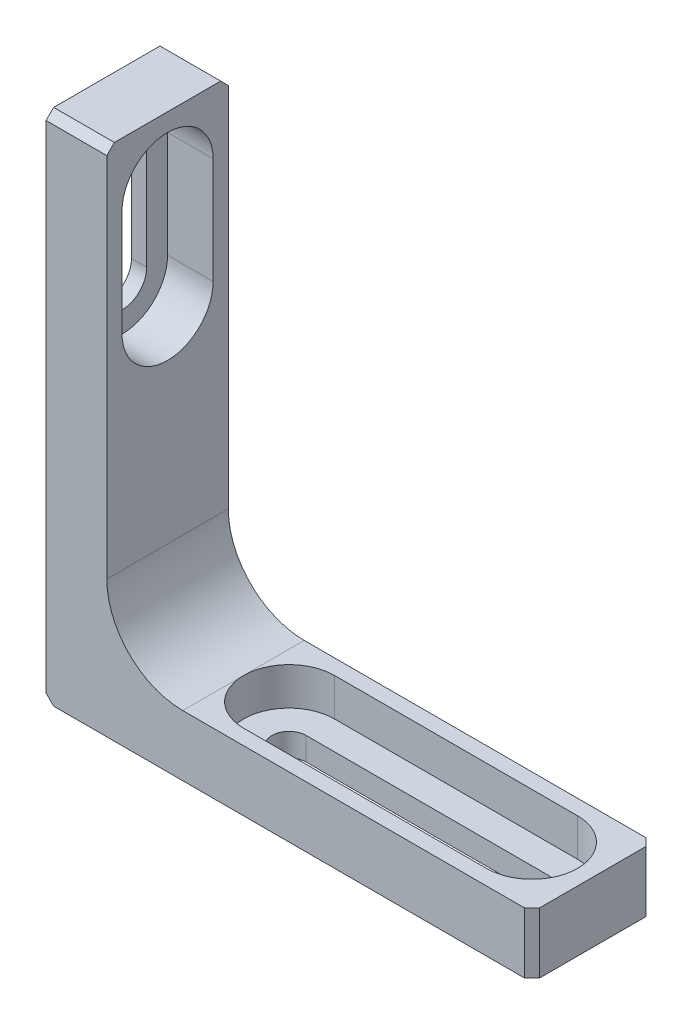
ISO-10303-21;
HEADER;
FILE_DESCRIPTION(('STEP AP214'),'2;1');
FILE_NAME('part.step','',(''),(''),'','','');
FILE_SCHEMA(('AUTOMOTIVE_DESIGN { 1 0 10303 214 1 1 1 1 }'));
ENDSEC;
DATA;
#1=APPLICATION_CONTEXT('core data for automotive mechanical design processes');
#2=APPLICATION_PROTOCOL_DEFINITION('international standard','automotive_design',2000,#1);
#3=PRODUCT_CONTEXT('',#1,'mechanical');
#4=PRODUCT('Part','Part','',(#3));
#5=PRODUCT_RELATED_PRODUCT_CATEGORY('part','',(#4));
#6=PRODUCT_DEFINITION_FORMATION('','',#4);
#7=PRODUCT_DEFINITION_CONTEXT('part definition',#1,'design');
#8=PRODUCT_DEFINITION('design','',#6,#7);
#9=PRODUCT_DEFINITION_SHAPE('','',#8);
#10=(LENGTH_UNIT() NAMED_UNIT(*) SI_UNIT(.MILLI.,.METRE.));
#11=(NAMED_UNIT(*) PLANE_ANGLE_UNIT() SI_UNIT($,.RADIAN.));
#12=(NAMED_UNIT(*) SI_UNIT($,.STERADIAN.) SOLID_ANGLE_UNIT());
#13=UNCERTAINTY_MEASURE_WITH_UNIT(LENGTH_MEASURE(1.E-05),#10,'distance_accuracy_value','');
#14=(GEOMETRIC_REPRESENTATION_CONTEXT(3) GLOBAL_UNCERTAINTY_ASSIGNED_CONTEXT((#13)) GLOBAL_UNIT_ASSIGNED_CONTEXT((#10,
#11,#12)) REPRESENTATION_CONTEXT('',''));
#15=CARTESIAN_POINT('',(0.,0.,0.));
#16=DIRECTION('',(0.,0.,1.));
#17=DIRECTION('',(1.,0.,0.));
#18=AXIS2_PLACEMENT_3D('',#15,#16,#17);
#19=CARTESIAN_POINT('',(12.7,106.828844,-12.7));
#20=DIRECTION('',(-1.,0.,0.));
#21=DIRECTION('',(0.,-1.,0.));
#22=AXIS2_PLACEMENT_3D('',#19,#20,#21);
#23=PLANE('',#22);
#24=DIRECTION('',(0.,-1.,0.));
#25=VECTOR('',#24,1.);
#26=CARTESIAN_POINT('',(12.7,106.828844,-12.7));
#27=LINE('',#26,#25);
#28=CARTESIAN_POINT('',(12.7,105.241344,-12.7));
#29=VERTEX_POINT('',#28);
#30=CARTESIAN_POINT('',(12.7,28.5750000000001,-12.7));
#31=VERTEX_POINT('',#30);
#32=EDGE_CURVE('E345',#29,#31,#27,.T.);
#33=ORIENTED_EDGE('',*,*,#32,.F.);
#34=DIRECTION('',(0.,0.707106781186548,0.707106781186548));
#35=VECTOR('',#34,1.);
#36=CARTESIAN_POINT('',(12.7,106.828844,-11.1125));
#37=LINE('',#36,#35);
#38=CARTESIAN_POINT('',(12.7,106.828844,-11.1125));
#39=VERTEX_POINT('',#38);
#40=EDGE_CURVE('E436',#29,#39,#37,.T.);
#41=ORIENTED_EDGE('',*,*,#40,.T.);
#42=DIRECTION('',(0.,0.,1.));
#43=VECTOR('',#42,1.);
#44=CARTESIAN_POINT('',(12.7,106.828844,-12.7));
#45=LINE('',#44,#43);
#46=CARTESIAN_POINT('',(12.7,106.828844,11.1125));
#47=VERTEX_POINT('',#46);
#48=EDGE_CURVE('E353',#39,#47,#45,.T.);
#49=ORIENTED_EDGE('',*,*,#48,.T.);
#50=DIRECTION('',(0.,0.707106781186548,-0.707106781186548));
#51=VECTOR('',#50,1.);
#52=CARTESIAN_POINT('',(12.7,105.241344,12.7));
#53=LINE('',#52,#51);
#54=CARTESIAN_POINT('',(12.7,105.241344,12.7));
#55=VERTEX_POINT('',#54);
#56=EDGE_CURVE('E434',#47,#55,#53,.F.);
#57=ORIENTED_EDGE('',*,*,#56,.T.);
#58=DIRECTION('',(0.,-1.,0.));
#59=VECTOR('',#58,1.);
#60=CARTESIAN_POINT('',(12.7,106.828844,12.7));
#61=LINE('',#60,#59);
#62=CARTESIAN_POINT('',(12.7,28.5750000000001,12.7));
#63=VERTEX_POINT('',#62);
#64=EDGE_CURVE('E329',#55,#63,#61,.T.);
#65=ORIENTED_EDGE('',*,*,#64,.T.);
#66=DIRECTION('',(0.,0.,1.));
#67=VECTOR('',#66,1.);
#68=CARTESIAN_POINT('',(12.7,28.5750000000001,-12.7));
#69=LINE('',#68,#67);
#70=EDGE_CURVE('E362',#31,#63,#69,.T.);
#71=ORIENTED_EDGE('',*,*,#70,.F.);
#72=EDGE_LOOP('',(#33,#41,#49,#57,#65,#71));
#73=FACE_BOUND('',#72,.T.);
#74=CARTESIAN_POINT('',(12.7,71.332344,0.));
#75=DIRECTION('',(-1.,0.,0.));
#76=DIRECTION('',(0.,-1.,0.));
#77=AXIS2_PLACEMENT_3D('',#74,#75,#76);
#78=CIRCLE('',#77,9.525);
#79=CARTESIAN_POINT('',(12.7,71.332344,9.525));
#80=VERTEX_POINT('',#79);
#81=CARTESIAN_POINT('',(12.7,71.332344,-9.525));
#82=VERTEX_POINT('',#81);
#83=EDGE_CURVE('E11',#80,#82,#78,.F.);
#84=ORIENTED_EDGE('',*,*,#83,.F.);
#85=DIRECTION('',(0.,-1.,0.));
#86=VECTOR('',#85,1.);
#87=CARTESIAN_POINT('',(12.7,106.828844,9.52500000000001));
#88=LINE('',#87,#86);
#89=CARTESIAN_POINT('',(12.7,93.557344,9.52500000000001));
#90=VERTEX_POINT('',#89);
#91=EDGE_CURVE('E440',#90,#80,#88,.T.);
#92=ORIENTED_EDGE('',*,*,#91,.F.);
#93=CARTESIAN_POINT('',(12.7,93.557344,0.));
#94=DIRECTION('',(-1.,0.,0.));
#95=DIRECTION('',(0.,-1.,0.));
#96=AXIS2_PLACEMENT_3D('',#93,#94,#95);
#97=CIRCLE('',#96,9.525);
#98=CARTESIAN_POINT('',(12.7,93.557344,-9.52499999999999));
#99=VERTEX_POINT('',#98);
#100=EDGE_CURVE('E442',#99,#90,#97,.F.);
#101=ORIENTED_EDGE('',*,*,#100,.F.);
#102=DIRECTION('',(0.,1.,0.));
#103=VECTOR('',#102,1.);
#104=CARTESIAN_POINT('',(12.7,106.828844,-9.525));
#105=LINE('',#104,#103);
#106=EDGE_CURVE('E45',#82,#99,#105,.T.);
#107=ORIENTED_EDGE('',*,*,#106,.F.);
#108=EDGE_LOOP('',(#84,#92,#101,#107));
#109=FACE_BOUND('',#108,.T.);
#110=ADVANCED_FACE('F37',(#73,#109),#23,.F.);
#111=CARTESIAN_POINT('',(0.,71.332344,0.));
#112=DIRECTION('',(1.,0.,0.));
#113=DIRECTION('',(0.,1.,0.));
#114=AXIS2_PLACEMENT_3D('',#111,#112,#113);
#115=CYLINDRICAL_SURFACE('',#114,5.1562);
#116=CARTESIAN_POINT('',(3.17499999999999,71.332344,0.));
#117=DIRECTION('',(1.,0.,0.));
#118=DIRECTION('',(0.,1.,0.));
#119=AXIS2_PLACEMENT_3D('',#116,#117,#118);
#120=CIRCLE('',#119,5.1562);
#121=CARTESIAN_POINT('',(3.17499999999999,71.332344,-5.1562));
#122=VERTEX_POINT('',#121);
#123=CARTESIAN_POINT('',(3.17499999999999,71.332344,5.1562));
#124=VERTEX_POINT('',#123);
#125=EDGE_CURVE('E258',#122,#124,#120,.F.);
#126=ORIENTED_EDGE('',*,*,#125,.F.);
#127=DIRECTION('',(1.,0.,0.));
#128=VECTOR('',#127,1.);
#129=CARTESIAN_POINT('',(0.,71.332344,-5.1562));
#130=LINE('',#129,#128);
#131=CARTESIAN_POINT('',(0.,71.332344,-5.1562));
#132=VERTEX_POINT('',#131);
#133=EDGE_CURVE('E325',#132,#122,#130,.T.);
#134=ORIENTED_EDGE('',*,*,#133,.F.);
#135=CARTESIAN_POINT('',(0.,71.332344,0.));
#136=DIRECTION('',(1.,0.,0.));
#137=DIRECTION('',(0.,1.,0.));
#138=AXIS2_PLACEMENT_3D('',#135,#136,#137);
#139=CIRCLE('',#138,5.1562);
#140=CARTESIAN_POINT('',(0.,71.332344,5.1562));
#141=VERTEX_POINT('',#140);
#142=EDGE_CURVE('E305',#141,#132,#139,.T.);
#143=ORIENTED_EDGE('',*,*,#142,.F.);
#144=DIRECTION('',(1.,0.,0.));
#145=VECTOR('',#144,1.);
#146=CARTESIAN_POINT('',(0.,71.332344,5.1562));
#147=LINE('',#146,#145);
#148=EDGE_CURVE('E326',#141,#124,#147,.T.);
#149=ORIENTED_EDGE('',*,*,#148,.T.);
#150=EDGE_LOOP('',(#126,#134,#143,#149));
#151=FACE_BOUND('',#150,.T.);
#152=ADVANCED_FACE('F458',(#151),#115,.F.);
#153=CARTESIAN_POINT('',(0.,71.332344,5.1562));
#154=DIRECTION('',(0.,0.,1.));
#155=DIRECTION('',(0.,-1.,0.));
#156=AXIS2_PLACEMENT_3D('',#153,#154,#155);
#157=PLANE('',#156);
#158=DIRECTION('',(0.,1.,0.));
#159=VECTOR('',#158,1.);
#160=CARTESIAN_POINT('',(3.17499999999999,71.332344,5.1562));
#161=LINE('',#160,#159);
#162=CARTESIAN_POINT('',(3.17499999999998,93.557344,5.15620000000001));
#163=VERTEX_POINT('',#162);
#164=EDGE_CURVE('E256',#124,#163,#161,.T.);
#165=ORIENTED_EDGE('',*,*,#164,.F.);
#166=ORIENTED_EDGE('',*,*,#148,.F.);
#167=DIRECTION('',(0.,-1.,0.));
#168=VECTOR('',#167,1.);
#169=CARTESIAN_POINT('',(0.,71.332344,5.1562));
#170=LINE('',#169,#168);
#171=CARTESIAN_POINT('',(0.,93.557344,5.15620000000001));
#172=VERTEX_POINT('',#171);
#173=EDGE_CURVE('E322',#172,#141,#170,.T.);
#174=ORIENTED_EDGE('',*,*,#173,.F.);
#175=DIRECTION('',(1.,0.,0.));
#176=VECTOR('',#175,1.);
#177=CARTESIAN_POINT('',(0.,93.557344,5.15620000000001));
#178=LINE('',#177,#176);
#179=EDGE_CURVE('E330',#172,#163,#178,.T.);
#180=ORIENTED_EDGE('',*,*,#179,.T.);
#181=EDGE_LOOP('',(#165,#166,#174,#180));
#182=FACE_BOUND('',#181,.T.);
#183=ADVANCED_FACE('F464',(#182),#157,.F.);
#184=CARTESIAN_POINT('',(0.,93.557344,0.));
#185=DIRECTION('',(1.,0.,0.));
#186=DIRECTION('',(0.,1.,0.));
#187=AXIS2_PLACEMENT_3D('',#184,#185,#186);
#188=CYLINDRICAL_SURFACE('',#187,5.1562);
#189=CARTESIAN_POINT('',(3.17499999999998,93.557344,0.));
#190=DIRECTION('',(1.,0.,0.));
#191=DIRECTION('',(0.,1.,0.));
#192=AXIS2_PLACEMENT_3D('',#189,#190,#191);
#193=CIRCLE('',#192,5.1562);
#194=CARTESIAN_POINT('',(3.17499999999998,93.557344,-5.15619999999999));
#195=VERTEX_POINT('',#194);
#196=EDGE_CURVE('E60',#163,#195,#193,.F.);
#197=ORIENTED_EDGE('',*,*,#196,.F.);
#198=ORIENTED_EDGE('',*,*,#179,.F.);
#199=CARTESIAN_POINT('',(0.,93.557344,0.));
#200=DIRECTION('',(1.,0.,0.));
#201=DIRECTION('',(0.,1.,0.));
#202=AXIS2_PLACEMENT_3D('',#199,#200,#201);
#203=CIRCLE('',#202,5.1562);
#204=CARTESIAN_POINT('',(0.,93.557344,-5.15619999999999));
#205=VERTEX_POINT('',#204);
#206=EDGE_CURVE('E319',#205,#172,#203,.T.);
#207=ORIENTED_EDGE('',*,*,#206,.F.);
#208=DIRECTION('',(1.,0.,0.));
#209=VECTOR('',#208,1.);
#210=CARTESIAN_POINT('',(0.,93.557344,-5.15619999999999));
#211=LINE('',#210,#209);
#212=EDGE_CURVE('E333',#205,#195,#211,.T.);
#213=ORIENTED_EDGE('',*,*,#212,.T.);
#214=EDGE_LOOP('',(#197,#198,#207,#213));
#215=FACE_BOUND('',#214,.T.);
#216=ADVANCED_FACE('F602',(#215),#188,.F.);
#217=CARTESIAN_POINT('',(0.,71.332344,-5.1562));
#218=DIRECTION('',(0.,0.,-1.));
#219=DIRECTION('',(0.,1.,0.));
#220=AXIS2_PLACEMENT_3D('',#217,#218,#219);
#221=PLANE('',#220);
#222=DIRECTION('',(0.,-1.,0.));
#223=VECTOR('',#222,1.);
#224=CARTESIAN_POINT('',(3.17499999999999,71.332344,-5.1562));
#225=LINE('',#224,#223);
#226=EDGE_CURVE('E438',#195,#122,#225,.T.);
#227=ORIENTED_EDGE('',*,*,#226,.F.);
#228=ORIENTED_EDGE('',*,*,#212,.F.);
#229=DIRECTION('',(0.,1.,0.));
#230=VECTOR('',#229,1.);
#231=CARTESIAN_POINT('',(0.,71.332344,-5.1562));
#232=LINE('',#231,#230);
#233=EDGE_CURVE('E316',#132,#205,#232,.T.);
#234=ORIENTED_EDGE('',*,*,#233,.F.);
#235=ORIENTED_EDGE('',*,*,#133,.T.);
#236=EDGE_LOOP('',(#227,#228,#234,#235));
#237=FACE_BOUND('',#236,.T.);
#238=ADVANCED_FACE('F606',(#237),#221,.F.);
#239=CARTESIAN_POINT('',(101.6,12.7,-12.7));
#240=DIRECTION('',(0.,-1.,0.));
#241=DIRECTION('',(1.,0.,0.));
#242=AXIS2_PLACEMENT_3D('',#239,#240,#241);
#243=PLANE('',#242);
#244=DIRECTION('',(0.,0.,1.));
#245=VECTOR('',#244,1.);
#246=CARTESIAN_POINT('',(101.6,12.7,-12.7));
#247=LINE('',#246,#245);
#248=CARTESIAN_POINT('',(101.6,12.7,-11.1125));
#249=VERTEX_POINT('',#248);
#250=CARTESIAN_POINT('',(101.6,12.7,11.1125));
#251=VERTEX_POINT('',#250);
#252=EDGE_CURVE('E354',#249,#251,#247,.T.);
#253=ORIENTED_EDGE('',*,*,#252,.F.);
#254=DIRECTION('',(-0.707106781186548,0.,-0.707106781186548));
#255=VECTOR('',#254,1.);
#256=CARTESIAN_POINT('',(101.6,12.7,-11.1125));
#257=LINE('',#256,#255);
#258=CARTESIAN_POINT('',(100.0125,12.7,-12.7));
#259=VERTEX_POINT('',#258);
#260=EDGE_CURVE('E427',#249,#259,#257,.T.);
#261=ORIENTED_EDGE('',*,*,#260,.T.);
#262=DIRECTION('',(1.,0.,0.));
#263=VECTOR('',#262,1.);
#264=CARTESIAN_POINT('',(101.6,12.7,-12.7));
#265=LINE('',#264,#263);
#266=CARTESIAN_POINT('',(28.5750000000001,12.7,-12.7));
#267=VERTEX_POINT('',#266);
#268=EDGE_CURVE('E350',#267,#259,#265,.T.);
#269=ORIENTED_EDGE('',*,*,#268,.F.);
#270=DIRECTION('',(0.,0.,1.));
#271=VECTOR('',#270,1.);
#272=CARTESIAN_POINT('',(28.5750000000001,12.7,-12.7));
#273=LINE('',#272,#271);
#274=CARTESIAN_POINT('',(28.5750000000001,12.7,0.));
#275=VERTEX_POINT('',#274);
#276=EDGE_CURVE('E358',#267,#275,#273,.T.);
#277=ORIENTED_EDGE('',*,*,#276,.T.);
#278=CARTESIAN_POINT('',(38.1,12.7,0.));
#279=DIRECTION('',(0.,-1.,0.));
#280=DIRECTION('',(1.,0.,0.));
#281=AXIS2_PLACEMENT_3D('',#278,#279,#280);
#282=CIRCLE('',#281,9.525);
#283=CARTESIAN_POINT('',(38.1,12.7,-9.525));
#284=VERTEX_POINT('',#283);
#285=EDGE_CURVE('E288',#284,#275,#282,.F.);
#286=ORIENTED_EDGE('',*,*,#285,.F.);
#287=DIRECTION('',(-1.,0.,0.));
#288=VECTOR('',#287,1.);
#289=CARTESIAN_POINT('',(101.6,12.7,-9.52500000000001));
#290=LINE('',#289,#288);
#291=CARTESIAN_POINT('',(88.9,12.7,-9.52500000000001));
#292=VERTEX_POINT('',#291);
#293=EDGE_CURVE('E386',#292,#284,#290,.T.);
#294=ORIENTED_EDGE('',*,*,#293,.F.);
#295=CARTESIAN_POINT('',(88.9,12.7,0.));
#296=DIRECTION('',(0.,-1.,0.));
#297=DIRECTION('',(1.,0.,0.));
#298=AXIS2_PLACEMENT_3D('',#295,#296,#297);
#299=CIRCLE('',#298,9.525);
#300=CARTESIAN_POINT('',(88.9,12.7,9.52499999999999));
#301=VERTEX_POINT('',#300);
#302=EDGE_CURVE('E388',#301,#292,#299,.F.);
#303=ORIENTED_EDGE('',*,*,#302,.F.);
#304=DIRECTION('',(1.,0.,0.));
#305=VECTOR('',#304,1.);
#306=CARTESIAN_POINT('',(101.6,12.7,9.52499999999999));
#307=LINE('',#306,#305);
#308=CARTESIAN_POINT('',(38.1,12.7,9.525));
#309=VERTEX_POINT('',#308);
#310=EDGE_CURVE('E391',#309,#301,#307,.T.);
#311=ORIENTED_EDGE('',*,*,#310,.F.);
#312=EDGE_CURVE('E286',#275,#309,#282,.F.);
#313=ORIENTED_EDGE('',*,*,#312,.F.);
#314=CARTESIAN_POINT('',(28.5750000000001,12.7,12.7));
#315=VERTEX_POINT('',#314);
#316=EDGE_CURVE('E361',#275,#315,#273,.T.);
#317=ORIENTED_EDGE('',*,*,#316,.T.);
#318=DIRECTION('',(1.,0.,0.));
#319=VECTOR('',#318,1.);
#320=CARTESIAN_POINT('',(101.6,12.7,12.7));
#321=LINE('',#320,#319);
#322=CARTESIAN_POINT('',(100.0125,12.7,12.7));
#323=VERTEX_POINT('',#322);
#324=EDGE_CURVE('E342',#315,#323,#321,.T.);
#325=ORIENTED_EDGE('',*,*,#324,.T.);
#326=DIRECTION('',(-0.707106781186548,0.,0.707106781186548));
#327=VECTOR('',#326,1.);
#328=CARTESIAN_POINT('',(100.0125,12.7,12.7));
#329=LINE('',#328,#327);
#330=EDGE_CURVE('E425',#323,#251,#329,.F.);
#331=ORIENTED_EDGE('',*,*,#330,.T.);
#332=EDGE_LOOP('',(#253,#261,#269,#277,#286,#294,#303,#311,#313,#317,#325,#331));
#333=FACE_BOUND('',#332,.T.);
#334=ADVANCED_FACE('F548',(#333),#243,.F.);
#335=CARTESIAN_POINT('',(38.1,0.,0.));
#336=DIRECTION('',(0.,1.,0.));
#337=DIRECTION('',(-1.,0.,0.));
#338=AXIS2_PLACEMENT_3D('',#335,#336,#337);
#339=CYLINDRICAL_SURFACE('',#338,3.5687);
#340=CARTESIAN_POINT('',(38.1,4.826,0.));
#341=DIRECTION('',(0.,1.,0.));
#342=DIRECTION('',(-1.,0.,0.));
#343=AXIS2_PLACEMENT_3D('',#340,#341,#342);
#344=CIRCLE('',#343,3.5687);
#345=CARTESIAN_POINT('',(38.1,4.826,3.56869999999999));
#346=VERTEX_POINT('',#345);
#347=CARTESIAN_POINT('',(38.1,4.826,-3.56870000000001));
#348=VERTEX_POINT('',#347);
#349=EDGE_CURVE('E284',#346,#348,#344,.F.);
#350=ORIENTED_EDGE('',*,*,#349,.F.);
#351=DIRECTION('',(0.,1.,0.));
#352=VECTOR('',#351,1.);
#353=CARTESIAN_POINT('',(38.1,0.,3.56869999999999));
#354=LINE('',#353,#352);
#355=CARTESIAN_POINT('',(38.1,0.,3.56869999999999));
#356=VERTEX_POINT('',#355);
#357=EDGE_CURVE('E301',#356,#346,#354,.T.);
#358=ORIENTED_EDGE('',*,*,#357,.F.);
#359=CARTESIAN_POINT('',(38.1,0.,0.));
#360=DIRECTION('',(0.,1.,0.));
#361=DIRECTION('',(-1.,0.,0.));
#362=AXIS2_PLACEMENT_3D('',#359,#360,#361);
#363=CIRCLE('',#362,3.5687);
#364=CARTESIAN_POINT('',(38.1,0.,-3.56870000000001));
#365=VERTEX_POINT('',#364);
#366=EDGE_CURVE('E289',#365,#356,#363,.T.);
#367=ORIENTED_EDGE('',*,*,#366,.F.);
#368=DIRECTION('',(0.,1.,0.));
#369=VECTOR('',#368,1.);
#370=CARTESIAN_POINT('',(38.1,0.,-3.56870000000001));
#371=LINE('',#370,#369);
#372=EDGE_CURVE('E302',#365,#348,#371,.T.);
#373=ORIENTED_EDGE('',*,*,#372,.T.);
#374=EDGE_LOOP('',(#350,#358,#367,#373));
#375=FACE_BOUND('',#374,.T.);
#376=ADVANCED_FACE('F589',(#375),#339,.F.);
#377=CARTESIAN_POINT('',(38.1,0.,-3.56870000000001));
#378=DIRECTION('',(0.,0.,-1.));
#379=DIRECTION('',(-1.,0.,0.));
#380=AXIS2_PLACEMENT_3D('',#377,#378,#379);
#381=PLANE('',#380);
#382=DIRECTION('',(1.,0.,0.));
#383=VECTOR('',#382,1.);
#384=CARTESIAN_POINT('',(38.1,4.826,-3.56870000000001));
#385=LINE('',#384,#383);
#386=CARTESIAN_POINT('',(88.9,4.82600000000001,-3.56870000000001));
#387=VERTEX_POINT('',#386);
#388=EDGE_CURVE('E282',#348,#387,#385,.T.);
#389=ORIENTED_EDGE('',*,*,#388,.F.);
#390=ORIENTED_EDGE('',*,*,#372,.F.);
#391=DIRECTION('',(-1.,0.,0.));
#392=VECTOR('',#391,1.);
#393=CARTESIAN_POINT('',(38.1,0.,-3.56870000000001));
#394=LINE('',#393,#392);
#395=CARTESIAN_POINT('',(88.9,0.,-3.56870000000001));
#396=VERTEX_POINT('',#395);
#397=EDGE_CURVE('E298',#396,#365,#394,.T.);
#398=ORIENTED_EDGE('',*,*,#397,.F.);
#399=DIRECTION('',(0.,1.,0.));
#400=VECTOR('',#399,1.);
#401=CARTESIAN_POINT('',(88.9,0.,-3.56870000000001));
#402=LINE('',#401,#400);
#403=EDGE_CURVE('E306',#396,#387,#402,.T.);
#404=ORIENTED_EDGE('',*,*,#403,.T.);
#405=EDGE_LOOP('',(#389,#390,#398,#404));
#406=FACE_BOUND('',#405,.T.);
#407=ADVANCED_FACE('F585',(#406),#381,.F.);
#408=CARTESIAN_POINT('',(88.9,0.,0.));
#409=DIRECTION('',(0.,1.,0.));
#410=DIRECTION('',(-1.,0.,0.));
#411=AXIS2_PLACEMENT_3D('',#408,#409,#410);
#412=CYLINDRICAL_SURFACE('',#411,3.5687);
#413=CARTESIAN_POINT('',(88.9,4.82600000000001,0.));
#414=DIRECTION('',(0.,1.,0.));
#415=DIRECTION('',(-1.,0.,0.));
#416=AXIS2_PLACEMENT_3D('',#413,#414,#415);
#417=CIRCLE('',#416,3.5687);
#418=CARTESIAN_POINT('',(88.9,4.826,3.56869999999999));
#419=VERTEX_POINT('',#418);
#420=EDGE_CURVE('E280',#387,#419,#417,.F.);
#421=ORIENTED_EDGE('',*,*,#420,.F.);
#422=ORIENTED_EDGE('',*,*,#403,.F.);
#423=CARTESIAN_POINT('',(88.9,0.,0.));
#424=DIRECTION('',(0.,1.,0.));
#425=DIRECTION('',(-1.,0.,0.));
#426=AXIS2_PLACEMENT_3D('',#423,#424,#425);
#427=CIRCLE('',#426,3.5687);
#428=CARTESIAN_POINT('',(88.9,0.,3.56869999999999));
#429=VERTEX_POINT('',#428);
#430=EDGE_CURVE('E295',#429,#396,#427,.T.);
#431=ORIENTED_EDGE('',*,*,#430,.F.);
#432=DIRECTION('',(0.,1.,0.));
#433=VECTOR('',#432,1.);
#434=CARTESIAN_POINT('',(88.9,0.,3.56869999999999));
#435=LINE('',#434,#433);
#436=EDGE_CURVE('E309',#429,#419,#435,.T.);
#437=ORIENTED_EDGE('',*,*,#436,.T.);
#438=EDGE_LOOP('',(#421,#422,#431,#437));
#439=FACE_BOUND('',#438,.T.);
#440=ADVANCED_FACE('F588',(#439),#412,.F.);
#441=CARTESIAN_POINT('',(38.1,0.,3.56869999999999));
#442=DIRECTION('',(0.,0.,1.));
#443=DIRECTION('',(1.,0.,0.));
#444=AXIS2_PLACEMENT_3D('',#441,#442,#443);
#445=PLANE('',#444);
#446=DIRECTION('',(-1.,0.,0.));
#447=VECTOR('',#446,1.);
#448=CARTESIAN_POINT('',(38.1,4.826,3.56869999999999));
#449=LINE('',#448,#447);
#450=EDGE_CURVE('E384',#419,#346,#449,.T.);
#451=ORIENTED_EDGE('',*,*,#450,.F.);
#452=ORIENTED_EDGE('',*,*,#436,.F.);
#453=DIRECTION('',(1.,0.,0.));
#454=VECTOR('',#453,1.);
#455=CARTESIAN_POINT('',(38.1,0.,3.56869999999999));
#456=LINE('',#455,#454);
#457=EDGE_CURVE('E292',#356,#429,#456,.T.);
#458=ORIENTED_EDGE('',*,*,#457,.F.);
#459=ORIENTED_EDGE('',*,*,#357,.T.);
#460=EDGE_LOOP('',(#451,#452,#458,#459));
#461=FACE_BOUND('',#460,.T.);
#462=ADVANCED_FACE('F495',(#461),#445,.F.);
#463=CARTESIAN_POINT('',(0.,0.,12.7));
#464=DIRECTION('',(1.,0.,0.));
#465=DIRECTION('',(0.,0.,-1.));
#466=AXIS2_PLACEMENT_3D('',#463,#464,#465);
#467=PLANE('',#466);
#468=ORIENTED_EDGE('',*,*,#173,.T.);
#469=ORIENTED_EDGE('',*,*,#142,.T.);
#470=ORIENTED_EDGE('',*,*,#233,.T.);
#471=ORIENTED_EDGE('',*,*,#206,.T.);
#472=EDGE_LOOP('',(#468,#469,#470,#471));
#473=FACE_BOUND('',#472,.T.);
#474=DIRECTION('',(0.,-1.,0.));
#475=VECTOR('',#474,1.);
#476=CARTESIAN_POINT('',(0.,0.,-12.7));
#477=LINE('',#476,#475);
#478=CARTESIAN_POINT('',(0.,105.241344,-12.7));
#479=VERTEX_POINT('',#478);
#480=CARTESIAN_POINT('',(0.,1.58750000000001,-12.7));
#481=VERTEX_POINT('',#480);
#482=EDGE_CURVE('E357',#479,#481,#477,.T.);
#483=ORIENTED_EDGE('',*,*,#482,.T.);
#484=DIRECTION('',(0.,0.,1.));
#485=VECTOR('',#484,1.);
#486=CARTESIAN_POINT('',(0.,1.58750000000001,12.7));
#487=LINE('',#486,#485);
#488=CARTESIAN_POINT('',(0.,1.58750000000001,12.7));
#489=VERTEX_POINT('',#488);
#490=EDGE_CURVE('E410',#481,#489,#487,.T.);
#491=ORIENTED_EDGE('',*,*,#490,.T.);
#492=DIRECTION('',(0.,-1.,0.));
#493=VECTOR('',#492,1.);
#494=CARTESIAN_POINT('',(0.,0.,12.7));
#495=LINE('',#494,#493);
#496=CARTESIAN_POINT('',(0.,105.241344,12.7));
#497=VERTEX_POINT('',#496);
#498=EDGE_CURVE('E367',#497,#489,#495,.T.);
#499=ORIENTED_EDGE('',*,*,#498,.F.);
#500=DIRECTION('',(0.,-0.707106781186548,0.707106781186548));
#501=VECTOR('',#500,1.);
#502=CARTESIAN_POINT('',(0.,105.241344,12.7));
#503=LINE('',#502,#501);
#504=CARTESIAN_POINT('',(0.,106.828844,11.1125));
#505=VERTEX_POINT('',#504);
#506=EDGE_CURVE('E406',#497,#505,#503,.F.);
#507=ORIENTED_EDGE('',*,*,#506,.T.);
#508=DIRECTION('',(0.,0.,-1.));
#509=VECTOR('',#508,1.);
#510=CARTESIAN_POINT('',(0.,106.828844,12.7));
#511=LINE('',#510,#509);
#512=CARTESIAN_POINT('',(0.,106.828844,-11.1125));
#513=VERTEX_POINT('',#512);
#514=EDGE_CURVE('E374',#505,#513,#511,.T.);
#515=ORIENTED_EDGE('',*,*,#514,.T.);
#516=DIRECTION('',(0.,-0.707106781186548,-0.707106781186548));
#517=VECTOR('',#516,1.);
#518=CARTESIAN_POINT('',(0.,106.828844,-11.1125));
#519=LINE('',#518,#517);
#520=EDGE_CURVE('E408',#513,#479,#519,.T.);
#521=ORIENTED_EDGE('',*,*,#520,.T.);
#522=EDGE_LOOP('',(#483,#491,#499,#507,#515,#521));
#523=FACE_BOUND('',#522,.T.);
#524=ADVANCED_FACE('F491',(#473,#523),#467,.F.);
#525=CARTESIAN_POINT('',(0.,0.,12.7));
#526=DIRECTION('',(0.,1.,0.));
#527=DIRECTION('',(0.,0.,1.));
#528=AXIS2_PLACEMENT_3D('',#525,#526,#527);
#529=PLANE('',#528);
#530=ORIENTED_EDGE('',*,*,#397,.T.);
#531=ORIENTED_EDGE('',*,*,#366,.T.);
#532=ORIENTED_EDGE('',*,*,#457,.T.);
#533=ORIENTED_EDGE('',*,*,#430,.T.);
#534=EDGE_LOOP('',(#530,#531,#532,#533));
#535=FACE_BOUND('',#534,.T.);
#536=DIRECTION('',(1.,0.,0.));
#537=VECTOR('',#536,1.);
#538=CARTESIAN_POINT('',(0.,0.,12.7));
#539=LINE('',#538,#537);
#540=CARTESIAN_POINT('',(1.58749999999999,0.,12.7));
#541=VERTEX_POINT('',#540);
#542=CARTESIAN_POINT('',(100.0125,0.,12.7));
#543=VERTEX_POINT('',#542);
#544=EDGE_CURVE('E370',#541,#543,#539,.T.);
#545=ORIENTED_EDGE('',*,*,#544,.F.);
#546=DIRECTION('',(0.,0.,-1.));
#547=VECTOR('',#546,1.);
#548=CARTESIAN_POINT('',(1.58749999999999,0.,12.7));
#549=LINE('',#548,#547);
#550=CARTESIAN_POINT('',(1.58749999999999,0.,-12.7));
#551=VERTEX_POINT('',#550);
#552=EDGE_CURVE('E397',#541,#551,#549,.T.);
#553=ORIENTED_EDGE('',*,*,#552,.T.);
#554=DIRECTION('',(1.,0.,0.));
#555=VECTOR('',#554,1.);
#556=CARTESIAN_POINT('',(0.,0.,-12.7));
#557=LINE('',#556,#555);
#558=CARTESIAN_POINT('',(100.0125,0.,-12.7));
#559=VERTEX_POINT('',#558);
#560=EDGE_CURVE('E371',#551,#559,#557,.T.);
#561=ORIENTED_EDGE('',*,*,#560,.T.);
#562=DIRECTION('',(0.707106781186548,0.,0.707106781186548));
#563=VECTOR('',#562,1.);
#564=CARTESIAN_POINT('',(101.6,0.,-11.1125));
#565=LINE('',#564,#563);
#566=CARTESIAN_POINT('',(101.6,0.,-11.1125));
#567=VERTEX_POINT('',#566);
#568=EDGE_CURVE('E395',#559,#567,#565,.T.);
#569=ORIENTED_EDGE('',*,*,#568,.T.);
#570=DIRECTION('',(0.,0.,-1.));
#571=VECTOR('',#570,1.);
#572=CARTESIAN_POINT('',(101.6,0.,12.7));
#573=LINE('',#572,#571);
#574=CARTESIAN_POINT('',(101.6,0.,11.1125));
#575=VERTEX_POINT('',#574);
#576=EDGE_CURVE('E381',#575,#567,#573,.T.);
#577=ORIENTED_EDGE('',*,*,#576,.F.);
#578=DIRECTION('',(0.707106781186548,0.,-0.707106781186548));
#579=VECTOR('',#578,1.);
#580=CARTESIAN_POINT('',(100.0125,0.,12.7));
#581=LINE('',#580,#579);
#582=EDGE_CURVE('E393',#575,#543,#581,.F.);
#583=ORIENTED_EDGE('',*,*,#582,.T.);
#584=EDGE_LOOP('',(#545,#553,#561,#569,#577,#583));
#585=FACE_BOUND('',#584,.T.);
#586=ADVANCED_FACE('F487',(#535,#585),#529,.F.);
#587=CARTESIAN_POINT('',(101.6,0.,12.7));
#588=DIRECTION('',(-1.,0.,0.));
#589=DIRECTION('',(0.,0.,1.));
#590=AXIS2_PLACEMENT_3D('',#587,#588,#589);
#591=PLANE('',#590);
#592=ORIENTED_EDGE('',*,*,#576,.T.);
#593=DIRECTION('',(0.,1.,0.));
#594=VECTOR('',#593,1.);
#595=CARTESIAN_POINT('',(101.6,12.7,-11.1125));
#596=LINE('',#595,#594);
#597=EDGE_CURVE('E422',#567,#249,#596,.T.);
#598=ORIENTED_EDGE('',*,*,#597,.T.);
#599=ORIENTED_EDGE('',*,*,#252,.T.);
#600=DIRECTION('',(0.,-1.,0.));
#601=VECTOR('',#600,1.);
#602=CARTESIAN_POINT('',(101.6,0.,11.1125));
#603=LINE('',#602,#601);
#604=EDGE_CURVE('E420',#251,#575,#603,.T.);
#605=ORIENTED_EDGE('',*,*,#604,.T.);
#606=EDGE_LOOP('',(#592,#598,#599,#605));
#607=FACE_BOUND('',#606,.T.);
#608=ADVANCED_FACE('F483',(#607),#591,.F.);
#609=CARTESIAN_POINT('',(0.,106.828844,12.7));
#610=DIRECTION('',(0.,-1.,0.));
#611=DIRECTION('',(0.,0.,-1.));
#612=AXIS2_PLACEMENT_3D('',#609,#610,#611);
#613=PLANE('',#612);
#614=ORIENTED_EDGE('',*,*,#48,.F.);
#615=DIRECTION('',(-1.,0.,0.));
#616=VECTOR('',#615,1.);
#617=CARTESIAN_POINT('',(0.,106.828844,-11.1125));
#618=LINE('',#617,#616);
#619=EDGE_CURVE('E431',#39,#513,#618,.T.);
#620=ORIENTED_EDGE('',*,*,#619,.T.);
#621=ORIENTED_EDGE('',*,*,#514,.F.);
#622=DIRECTION('',(1.,0.,0.));
#623=VECTOR('',#622,1.);
#624=CARTESIAN_POINT('',(0.,106.828844,11.1125));
#625=LINE('',#624,#623);
#626=EDGE_CURVE('E429',#505,#47,#625,.T.);
#627=ORIENTED_EDGE('',*,*,#626,.T.);
#628=EDGE_LOOP('',(#614,#620,#621,#627));
#629=FACE_BOUND('',#628,.T.);
#630=ADVANCED_FACE('F476',(#629),#613,.F.);
#631=CARTESIAN_POINT('',(0.,0.,12.7));
#632=DIRECTION('',(0.,0.,-1.));
#633=DIRECTION('',(-1.,0.,0.));
#634=AXIS2_PLACEMENT_3D('',#631,#632,#633);
#635=PLANE('',#634);
#636=ORIENTED_EDGE('',*,*,#498,.T.);
#637=DIRECTION('',(-0.707106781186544,0.707106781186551,0.));
#638=VECTOR('',#637,1.);
#639=CARTESIAN_POINT('',(1.58749999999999,0.,12.7));
#640=LINE('',#639,#638);
#641=EDGE_CURVE('E418',#489,#541,#640,.F.);
#642=ORIENTED_EDGE('',*,*,#641,.T.);
#643=ORIENTED_EDGE('',*,*,#544,.T.);
#644=DIRECTION('',(0.,1.,0.));
#645=VECTOR('',#644,1.);
#646=CARTESIAN_POINT('',(100.0125,0.,12.7));
#647=LINE('',#646,#645);
#648=EDGE_CURVE('E415',#543,#323,#647,.T.);
#649=ORIENTED_EDGE('',*,*,#648,.T.);
#650=ORIENTED_EDGE('',*,*,#324,.F.);
#651=CARTESIAN_POINT('',(28.575,28.575,12.7));
#652=DIRECTION('',(0.,0.,1.));
#653=DIRECTION('',(-1.,0.,0.));
#654=AXIS2_PLACEMENT_3D('',#651,#652,#653);
#655=CIRCLE('',#654,15.875);
#656=EDGE_CURVE('E339',#63,#315,#655,.T.);
#657=ORIENTED_EDGE('',*,*,#656,.F.);
#658=ORIENTED_EDGE('',*,*,#64,.F.);
#659=DIRECTION('',(-1.,0.,0.));
#660=VECTOR('',#659,1.);
#661=CARTESIAN_POINT('',(0.,105.241344,12.7));
#662=LINE('',#661,#660);
#663=EDGE_CURVE('E412',#55,#497,#662,.T.);
#664=ORIENTED_EDGE('',*,*,#663,.T.);
#665=EDGE_LOOP('',(#636,#642,#643,#649,#650,#657,#658,#664));
#666=FACE_BOUND('',#665,.T.);
#667=ADVANCED_FACE('F472',(#666),#635,.F.);
#668=CARTESIAN_POINT('',(0.,0.,-12.7));
#669=DIRECTION('',(0.,0.,-1.));
#670=DIRECTION('',(-1.,0.,0.));
#671=AXIS2_PLACEMENT_3D('',#668,#669,#670);
#672=PLANE('',#671);
#673=ORIENTED_EDGE('',*,*,#560,.F.);
#674=DIRECTION('',(0.707106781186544,-0.707106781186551,0.));
#675=VECTOR('',#674,1.);
#676=CARTESIAN_POINT('',(0.793750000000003,0.793749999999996,-12.7));
#677=LINE('',#676,#675);
#678=EDGE_CURVE('E404',#551,#481,#677,.F.);
#679=ORIENTED_EDGE('',*,*,#678,.T.);
#680=ORIENTED_EDGE('',*,*,#482,.F.);
#681=DIRECTION('',(1.,0.,0.));
#682=VECTOR('',#681,1.);
#683=CARTESIAN_POINT('',(12.7,105.241344,-12.7));
#684=LINE('',#683,#682);
#685=EDGE_CURVE('E400',#479,#29,#684,.T.);
#686=ORIENTED_EDGE('',*,*,#685,.T.);
#687=ORIENTED_EDGE('',*,*,#32,.T.);
#688=CARTESIAN_POINT('',(28.575,28.575,-12.7));
#689=DIRECTION('',(0.,0.,1.));
#690=DIRECTION('',(-1.,0.,0.));
#691=AXIS2_PLACEMENT_3D('',#688,#689,#690);
#692=CIRCLE('',#691,15.875);
#693=EDGE_CURVE('E347',#31,#267,#692,.T.);
#694=ORIENTED_EDGE('',*,*,#693,.T.);
#695=ORIENTED_EDGE('',*,*,#268,.T.);
#696=DIRECTION('',(0.,-1.,0.));
#697=VECTOR('',#696,1.);
#698=CARTESIAN_POINT('',(100.0125,0.,-12.7));
#699=LINE('',#698,#697);
#700=EDGE_CURVE('E402',#259,#559,#699,.T.);
#701=ORIENTED_EDGE('',*,*,#700,.T.);
#702=EDGE_LOOP('',(#673,#679,#680,#686,#687,#694,#695,#701));
#703=FACE_BOUND('',#702,.T.);
#704=ADVANCED_FACE('F475',(#703),#672,.T.);
#705=CARTESIAN_POINT('',(28.575,28.575,-12.7));
#706=DIRECTION('',(0.,0.,1.));
#707=DIRECTION('',(1.,0.,0.));
#708=AXIS2_PLACEMENT_3D('',#705,#706,#707);
#709=CYLINDRICAL_SURFACE('',#708,15.875);
#710=ORIENTED_EDGE('',*,*,#276,.F.);
#711=ORIENTED_EDGE('',*,*,#693,.F.);
#712=ORIENTED_EDGE('',*,*,#70,.T.);
#713=ORIENTED_EDGE('',*,*,#656,.T.);
#714=ORIENTED_EDGE('',*,*,#316,.F.);
#715=EDGE_LOOP('',(#710,#711,#712,#713,#714));
#716=FACE_BOUND('',#715,.T.);
#717=ADVANCED_FACE('F470',(#716),#709,.F.);
#718=CARTESIAN_POINT('',(38.1,106.828844,9.525));
#719=DIRECTION('',(0.,0.,-1.));
#720=DIRECTION('',(-1.,0.,0.));
#721=AXIS2_PLACEMENT_3D('',#718,#719,#720);
#722=PLANE('',#721);
#723=ORIENTED_EDGE('',*,*,#310,.T.);
#724=DIRECTION('',(0.,-1.,0.));
#725=VECTOR('',#724,1.);
#726=CARTESIAN_POINT('',(88.9,106.828844,9.52499999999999));
#727=LINE('',#726,#725);
#728=CARTESIAN_POINT('',(88.9,4.82600000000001,9.52499999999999));
#729=VERTEX_POINT('',#728);
#730=EDGE_CURVE('E276',#301,#729,#727,.T.);
#731=ORIENTED_EDGE('',*,*,#730,.T.);
#732=DIRECTION('',(1.,0.,0.));
#733=VECTOR('',#732,1.);
#734=CARTESIAN_POINT('',(38.1,4.826,9.525));
#735=LINE('',#734,#733);
#736=CARTESIAN_POINT('',(38.1,4.826,9.525));
#737=VERTEX_POINT('',#736);
#738=EDGE_CURVE('E263',#737,#729,#735,.T.);
#739=ORIENTED_EDGE('',*,*,#738,.F.);
#740=DIRECTION('',(0.,-1.,0.));
#741=VECTOR('',#740,1.);
#742=CARTESIAN_POINT('',(38.1,106.828844,9.525));
#743=LINE('',#742,#741);
#744=EDGE_CURVE('E278',#309,#737,#743,.T.);
#745=ORIENTED_EDGE('',*,*,#744,.F.);
#746=EDGE_LOOP('',(#723,#731,#739,#745));
#747=FACE_BOUND('',#746,.T.);
#748=ADVANCED_FACE('F560',(#747),#722,.T.);
#749=CARTESIAN_POINT('',(88.9,106.828844,0.));
#750=DIRECTION('',(0.,-1.,0.));
#751=DIRECTION('',(1.,0.,0.));
#752=AXIS2_PLACEMENT_3D('',#749,#750,#751);
#753=CYLINDRICAL_SURFACE('',#752,9.525);
#754=ORIENTED_EDGE('',*,*,#302,.T.);
#755=DIRECTION('',(0.,-1.,0.));
#756=VECTOR('',#755,1.);
#757=CARTESIAN_POINT('',(88.9,106.828844,-9.52500000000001));
#758=LINE('',#757,#756);
#759=CARTESIAN_POINT('',(88.9,4.82600000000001,-9.52500000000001));
#760=VERTEX_POINT('',#759);
#761=EDGE_CURVE('E274',#292,#760,#758,.T.);
#762=ORIENTED_EDGE('',*,*,#761,.T.);
#763=CARTESIAN_POINT('',(88.9,4.82600000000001,0.));
#764=DIRECTION('',(0.,1.,0.));
#765=DIRECTION('',(-1.,0.,0.));
#766=AXIS2_PLACEMENT_3D('',#763,#764,#765);
#767=CIRCLE('',#766,9.525);
#768=EDGE_CURVE('E266',#729,#760,#767,.T.);
#769=ORIENTED_EDGE('',*,*,#768,.F.);
#770=ORIENTED_EDGE('',*,*,#730,.F.);
#771=EDGE_LOOP('',(#754,#762,#769,#770));
#772=FACE_BOUND('',#771,.T.);
#773=ADVANCED_FACE('F572',(#772),#753,.F.);
#774=CARTESIAN_POINT('',(38.1,106.828844,-9.525));
#775=DIRECTION('',(0.,0.,1.));
#776=DIRECTION('',(1.,0.,0.));
#777=AXIS2_PLACEMENT_3D('',#774,#775,#776);
#778=PLANE('',#777);
#779=ORIENTED_EDGE('',*,*,#293,.T.);
#780=DIRECTION('',(0.,-1.,0.));
#781=VECTOR('',#780,1.);
#782=CARTESIAN_POINT('',(38.1,106.828844,-9.525));
#783=LINE('',#782,#781);
#784=CARTESIAN_POINT('',(38.1,4.826,-9.525));
#785=VERTEX_POINT('',#784);
#786=EDGE_CURVE('E272',#284,#785,#783,.T.);
#787=ORIENTED_EDGE('',*,*,#786,.T.);
#788=DIRECTION('',(-1.,0.,0.));
#789=VECTOR('',#788,1.);
#790=CARTESIAN_POINT('',(38.1,4.826,-9.525));
#791=LINE('',#790,#789);
#792=EDGE_CURVE('E269',#760,#785,#791,.T.);
#793=ORIENTED_EDGE('',*,*,#792,.F.);
#794=ORIENTED_EDGE('',*,*,#761,.F.);
#795=EDGE_LOOP('',(#779,#787,#793,#794));
#796=FACE_BOUND('',#795,.T.);
#797=ADVANCED_FACE('F570',(#796),#778,.T.);
#798=CARTESIAN_POINT('',(38.1,106.828844,0.));
#799=DIRECTION('',(0.,-1.,0.));
#800=DIRECTION('',(1.,0.,0.));
#801=AXIS2_PLACEMENT_3D('',#798,#799,#800);
#802=CYLINDRICAL_SURFACE('',#801,9.525);
#803=ORIENTED_EDGE('',*,*,#285,.T.);
#804=ORIENTED_EDGE('',*,*,#312,.T.);
#805=ORIENTED_EDGE('',*,*,#744,.T.);
#806=CARTESIAN_POINT('',(38.1,4.826,0.));
#807=DIRECTION('',(0.,1.,0.));
#808=DIRECTION('',(-1.,0.,0.));
#809=AXIS2_PLACEMENT_3D('',#806,#807,#808);
#810=CIRCLE('',#809,9.525);
#811=EDGE_CURVE('E260',#785,#737,#810,.T.);
#812=ORIENTED_EDGE('',*,*,#811,.F.);
#813=ORIENTED_EDGE('',*,*,#786,.F.);
#814=EDGE_LOOP('',(#803,#804,#805,#812,#813));
#815=FACE_BOUND('',#814,.T.);
#816=ADVANCED_FACE('F554',(#815),#802,.F.);
#817=CARTESIAN_POINT('',(38.1,4.826,0.));
#818=DIRECTION('',(0.,1.,0.));
#819=DIRECTION('',(-1.,0.,0.));
#820=AXIS2_PLACEMENT_3D('',#817,#818,#819);
#821=PLANE('',#820);
#822=ORIENTED_EDGE('',*,*,#811,.T.);
#823=ORIENTED_EDGE('',*,*,#738,.T.);
#824=ORIENTED_EDGE('',*,*,#768,.T.);
#825=ORIENTED_EDGE('',*,*,#792,.T.);
#826=EDGE_LOOP('',(#822,#823,#824,#825));
#827=FACE_BOUND('',#826,.T.);
#828=ORIENTED_EDGE('',*,*,#349,.T.);
#829=ORIENTED_EDGE('',*,*,#388,.T.);
#830=ORIENTED_EDGE('',*,*,#420,.T.);
#831=ORIENTED_EDGE('',*,*,#450,.T.);
#832=EDGE_LOOP('',(#828,#829,#830,#831));
#833=FACE_BOUND('',#832,.T.);
#834=ADVANCED_FACE('F501',(#827,#833),#821,.T.);
#835=CARTESIAN_POINT('',(1.58749999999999,0.,12.7));
#836=DIRECTION('',(0.707106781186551,0.707106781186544,0.));
#837=DIRECTION('',(0.,0.,-1.));
#838=AXIS2_PLACEMENT_3D('',#835,#836,#837);
#839=PLANE('',#838);
#840=ORIENTED_EDGE('',*,*,#641,.F.);
#841=ORIENTED_EDGE('',*,*,#490,.F.);
#842=ORIENTED_EDGE('',*,*,#678,.F.);
#843=ORIENTED_EDGE('',*,*,#552,.F.);
#844=EDGE_LOOP('',(#840,#841,#842,#843));
#845=FACE_BOUND('',#844,.T.);
#846=ADVANCED_FACE('F497',(#845),#839,.F.);
#847=CARTESIAN_POINT('',(101.6,0.,-11.1125));
#848=DIRECTION('',(0.707106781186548,0.,-0.707106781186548));
#849=DIRECTION('',(0.,-1.,0.));
#850=AXIS2_PLACEMENT_3D('',#847,#848,#849);
#851=PLANE('',#850);
#852=ORIENTED_EDGE('',*,*,#568,.F.);
#853=ORIENTED_EDGE('',*,*,#700,.F.);
#854=ORIENTED_EDGE('',*,*,#260,.F.);
#855=ORIENTED_EDGE('',*,*,#597,.F.);
#856=EDGE_LOOP('',(#852,#853,#854,#855));
#857=FACE_BOUND('',#856,.T.);
#858=ADVANCED_FACE('F500',(#857),#851,.T.);
#859=CARTESIAN_POINT('',(100.0125,0.,12.7));
#860=DIRECTION('',(-0.707106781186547,0.,-0.707106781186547));
#861=DIRECTION('',(0.,1.,0.));
#862=AXIS2_PLACEMENT_3D('',#859,#860,#861);
#863=PLANE('',#862);
#864=ORIENTED_EDGE('',*,*,#582,.F.);
#865=ORIENTED_EDGE('',*,*,#604,.F.);
#866=ORIENTED_EDGE('',*,*,#330,.F.);
#867=ORIENTED_EDGE('',*,*,#648,.F.);
#868=EDGE_LOOP('',(#864,#865,#866,#867));
#869=FACE_BOUND('',#868,.T.);
#870=ADVANCED_FACE('F505',(#869),#863,.F.);
#871=CARTESIAN_POINT('',(0.,106.828844,-11.1125));
#872=DIRECTION('',(0.,0.707106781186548,-0.707106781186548));
#873=DIRECTION('',(1.,0.,0.));
#874=AXIS2_PLACEMENT_3D('',#871,#872,#873);
#875=PLANE('',#874);
#876=ORIENTED_EDGE('',*,*,#40,.F.);
#877=ORIENTED_EDGE('',*,*,#685,.F.);
#878=ORIENTED_EDGE('',*,*,#520,.F.);
#879=ORIENTED_EDGE('',*,*,#619,.F.);
#880=EDGE_LOOP('',(#876,#877,#878,#879));
#881=FACE_BOUND('',#880,.T.);
#882=ADVANCED_FACE('F508',(#881),#875,.T.);
#883=CARTESIAN_POINT('',(0.,105.241344,12.7));
#884=DIRECTION('',(0.,-0.707106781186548,-0.707106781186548));
#885=DIRECTION('',(-1.,0.,0.));
#886=AXIS2_PLACEMENT_3D('',#883,#884,#885);
#887=PLANE('',#886);
#888=ORIENTED_EDGE('',*,*,#56,.F.);
#889=ORIENTED_EDGE('',*,*,#626,.F.);
#890=ORIENTED_EDGE('',*,*,#506,.F.);
#891=ORIENTED_EDGE('',*,*,#663,.F.);
#892=EDGE_LOOP('',(#888,#889,#890,#891));
#893=FACE_BOUND('',#892,.T.);
#894=ADVANCED_FACE('F39',(#893),#887,.F.);
#895=CARTESIAN_POINT('',(101.6,71.332344,0.));
#896=DIRECTION('',(-1.,0.,0.));
#897=DIRECTION('',(0.,-1.,0.));
#898=AXIS2_PLACEMENT_3D('',#895,#896,#897);
#899=CYLINDRICAL_SURFACE('',#898,9.525);
#900=ORIENTED_EDGE('',*,*,#83,.T.);
#901=DIRECTION('',(-1.,0.,0.));
#902=VECTOR('',#901,1.);
#903=CARTESIAN_POINT('',(101.6,71.332344,-9.525));
#904=LINE('',#903,#902);
#905=CARTESIAN_POINT('',(3.17499999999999,71.332344,-9.525));
#906=VERTEX_POINT('',#905);
#907=EDGE_CURVE('E224',#82,#906,#904,.T.);
#908=ORIENTED_EDGE('',*,*,#907,.T.);
#909=CARTESIAN_POINT('',(3.17499999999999,71.332344,0.));
#910=DIRECTION('',(1.,0.,0.));
#911=DIRECTION('',(0.,1.,0.));
#912=AXIS2_PLACEMENT_3D('',#909,#910,#911);
#913=CIRCLE('',#912,9.525);
#914=CARTESIAN_POINT('',(3.17499999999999,71.332344,9.525));
#915=VERTEX_POINT('',#914);
#916=EDGE_CURVE('E229',#915,#906,#913,.T.);
#917=ORIENTED_EDGE('',*,*,#916,.F.);
#918=DIRECTION('',(-1.,0.,0.));
#919=VECTOR('',#918,1.);
#920=CARTESIAN_POINT('',(101.6,71.332344,9.525));
#921=LINE('',#920,#919);
#922=EDGE_CURVE('E251',#80,#915,#921,.T.);
#923=ORIENTED_EDGE('',*,*,#922,.F.);
#924=EDGE_LOOP('',(#900,#908,#917,#923));
#925=FACE_BOUND('',#924,.T.);
#926=ADVANCED_FACE('F226',(#925),#899,.F.);
#927=CARTESIAN_POINT('',(101.6,71.332344,-9.525));
#928=DIRECTION('',(0.,0.,1.));
#929=DIRECTION('',(0.,-1.,0.));
#930=AXIS2_PLACEMENT_3D('',#927,#928,#929);
#931=PLANE('',#930);
#932=ORIENTED_EDGE('',*,*,#106,.T.);
#933=DIRECTION('',(-1.,0.,0.));
#934=VECTOR('',#933,1.);
#935=CARTESIAN_POINT('',(101.6,93.557344,-9.52499999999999));
#936=LINE('',#935,#934);
#937=CARTESIAN_POINT('',(3.17499999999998,93.557344,-9.52499999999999));
#938=VERTEX_POINT('',#937);
#939=EDGE_CURVE('E234',#99,#938,#936,.T.);
#940=ORIENTED_EDGE('',*,*,#939,.T.);
#941=DIRECTION('',(0.,1.,0.));
#942=VECTOR('',#941,1.);
#943=CARTESIAN_POINT('',(3.17499999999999,71.332344,-9.525));
#944=LINE('',#943,#942);
#945=EDGE_CURVE('E237',#906,#938,#944,.T.);
#946=ORIENTED_EDGE('',*,*,#945,.F.);
#947=ORIENTED_EDGE('',*,*,#907,.F.);
#948=EDGE_LOOP('',(#932,#940,#946,#947));
#949=FACE_BOUND('',#948,.T.);
#950=ADVANCED_FACE('F238',(#949),#931,.T.);
#951=CARTESIAN_POINT('',(101.6,93.557344,0.));
#952=DIRECTION('',(-1.,0.,0.));
#953=DIRECTION('',(0.,-1.,0.));
#954=AXIS2_PLACEMENT_3D('',#951,#952,#953);
#955=CYLINDRICAL_SURFACE('',#954,9.525);
#956=ORIENTED_EDGE('',*,*,#100,.T.);
#957=DIRECTION('',(-1.,0.,0.));
#958=VECTOR('',#957,1.);
#959=CARTESIAN_POINT('',(101.6,93.557344,9.525));
#960=LINE('',#959,#958);
#961=CARTESIAN_POINT('',(3.17499999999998,93.557344,9.525));
#962=VERTEX_POINT('',#961);
#963=EDGE_CURVE('E52',#90,#962,#960,.T.);
#964=ORIENTED_EDGE('',*,*,#963,.T.);
#965=CARTESIAN_POINT('',(3.17499999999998,93.557344,0.));
#966=DIRECTION('',(1.,0.,0.));
#967=DIRECTION('',(0.,1.,0.));
#968=AXIS2_PLACEMENT_3D('',#965,#966,#967);
#969=CIRCLE('',#968,9.525);
#970=EDGE_CURVE('E243',#938,#962,#969,.T.);
#971=ORIENTED_EDGE('',*,*,#970,.F.);
#972=ORIENTED_EDGE('',*,*,#939,.F.);
#973=EDGE_LOOP('',(#956,#964,#971,#972));
#974=FACE_BOUND('',#973,.T.);
#975=ADVANCED_FACE('F446',(#974),#955,.F.);
#976=CARTESIAN_POINT('',(101.6,71.332344,9.525));
#977=DIRECTION('',(0.,0.,-1.));
#978=DIRECTION('',(0.,1.,0.));
#979=AXIS2_PLACEMENT_3D('',#976,#977,#978);
#980=PLANE('',#979);
#981=ORIENTED_EDGE('',*,*,#91,.T.);
#982=ORIENTED_EDGE('',*,*,#922,.T.);
#983=DIRECTION('',(0.,-1.,0.));
#984=VECTOR('',#983,1.);
#985=CARTESIAN_POINT('',(3.17499999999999,71.332344,9.525));
#986=LINE('',#985,#984);
#987=EDGE_CURVE('E246',#962,#915,#986,.T.);
#988=ORIENTED_EDGE('',*,*,#987,.F.);
#989=ORIENTED_EDGE('',*,*,#963,.F.);
#990=EDGE_LOOP('',(#981,#982,#988,#989));
#991=FACE_BOUND('',#990,.T.);
#992=ADVANCED_FACE('F448',(#991),#980,.T.);
#993=CARTESIAN_POINT('',(3.17499999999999,71.332344,0.));
#994=DIRECTION('',(1.,0.,0.));
#995=DIRECTION('',(0.,1.,0.));
#996=AXIS2_PLACEMENT_3D('',#993,#994,#995);
#997=PLANE('',#996);
#998=ORIENTED_EDGE('',*,*,#916,.T.);
#999=ORIENTED_EDGE('',*,*,#945,.T.);
#1000=ORIENTED_EDGE('',*,*,#970,.T.);
#1001=ORIENTED_EDGE('',*,*,#987,.T.);
#1002=EDGE_LOOP('',(#998,#999,#1000,#1001));
#1003=FACE_BOUND('',#1002,.T.);
#1004=ORIENTED_EDGE('',*,*,#125,.T.);
#1005=ORIENTED_EDGE('',*,*,#164,.T.);
#1006=ORIENTED_EDGE('',*,*,#196,.T.);
#1007=ORIENTED_EDGE('',*,*,#226,.T.);
#1008=EDGE_LOOP('',(#1004,#1005,#1006,#1007));
#1009=FACE_BOUND('',#1008,.T.);
#1010=ADVANCED_FACE('F245',(#1003,#1009),#997,.T.);
#1011=CLOSED_SHELL('',(#110,#152,#183,#216,#238,#334,#376,#407,#440,#462,#524,#586,#608,#630,
#667,#704,#717,#748,#773,#797,#816,#834,#846,#858,#870,#882,#894,#926,#950,#975,#992,#1010));
#1012=MANIFOLD_SOLID_BREP('B2',#1011);
#1013=ADVANCED_BREP_SHAPE_REPRESENTATION('',(#18,#1012),#14);
#1014=SHAPE_DEFINITION_REPRESENTATION(#9,#1013);
ENDSEC;
END-ISO-10303-21;
